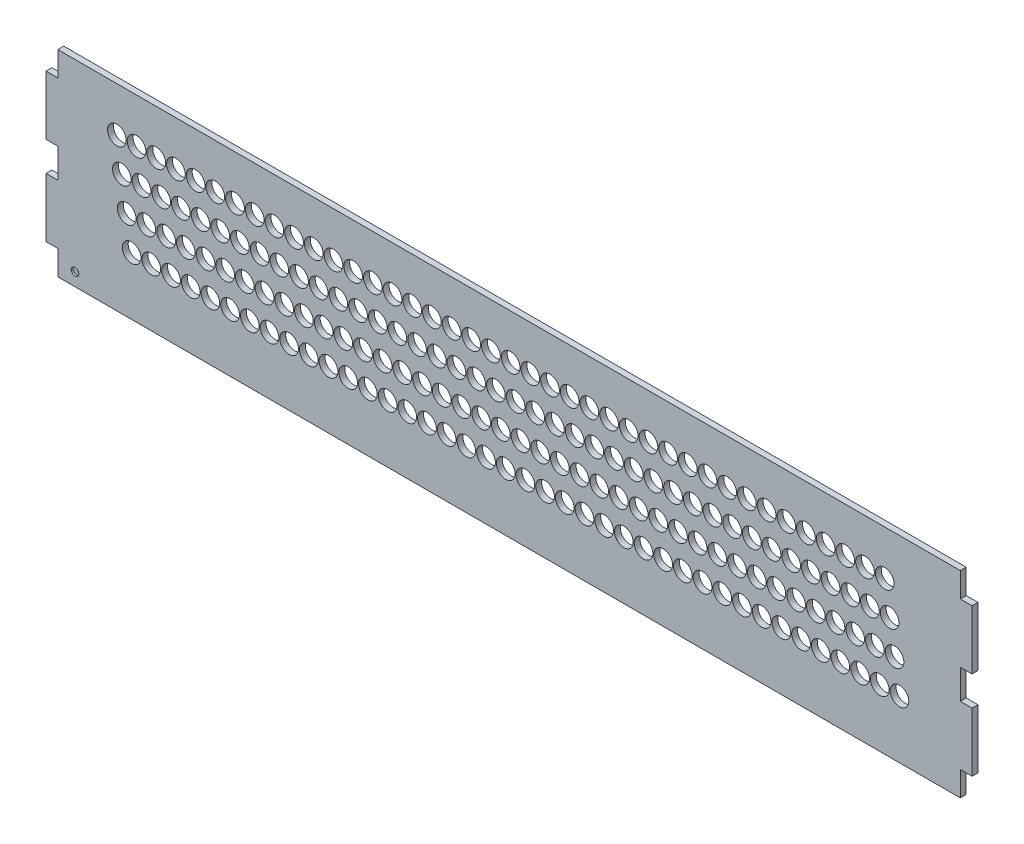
from build123d import *

# Parameters (mm, degrees)
CROQUIS1_W              = 458.4
CROQUIS1_H              = 100
SALIENTE_EXTRUIR1_DEPTH = 3
CROQUIS2_W              = 3
CROQUIS2_H              = 30
SALIENTE_EXTRUIR2_DEPTH = 6
CROQUIS3_W              = 3
CROQUIS3_H              = 30
SALIENTE_EXTRUIR3_DEPTH = 6
CORTAR_EXTRUIR1_REACH   = 242.475
CROQUIS4_R              = 4.75
MATRIZL1_COUNT          = 40
MATRIZL1_PITCH          = 10
CROQUIS5_R              = 1.93471248
CORTAR_EXTRUIR2_DEPTH   = 1


with BuildPart() as part:
    # Croquis1 → Saliente-Extruir1 (new body)
    with BuildSketch(Plane.XY):
        Rectangle(CROQUIS1_W, CROQUIS1_H)
    extrude(amount=SALIENTE_EXTRUIR1_DEPTH)

    # Croquis2 → Saliente-Extruir2 (add)
    with BuildSketch(Plane.ZY.offset(229.2)):
        with Locations((1.5, 22.5)):
            Rectangle(CROQUIS2_W, CROQUIS2_H)
        with Locations((1.5, -22.5)):
            Rectangle(CROQUIS2_W, CROQUIS2_H)
    extrude(amount=SALIENTE_EXTRUIR2_DEPTH)

    # Croquis3 → Saliente-Extruir3 (add)
    with BuildSketch(Plane(origin=(229.2, 0, 0), x_dir=(0, 0, -1), z_dir=(1, 0, 0))):
        with Locations((-1.5, -22.5)):
            Rectangle(CROQUIS3_W, CROQUIS3_H)
        with Locations((-1.5, 22.5)):
            Rectangle(CROQUIS3_W, CROQUIS3_H)
    extrude(amount=SALIENTE_EXTRUIR3_DEPTH)

    # Croquis4 → Cortar-Extruir1 (cut, up to next)
    with BuildSketch(Plane.XY.offset(3), mode=Mode.PRIVATE) as cortar_extruir1_sk1:
        with Locations((-199.2, 27.4)):
            Circle(CROQUIS4_R)
    cortar_extruir1_tool1 = extrude(cortar_extruir1_sk1.sketch, amount=-CORTAR_EXTRUIR1_REACH, mode=Mode.PRIVATE) & part.part
    # Croquis4 → Cortar-Extruir1 (cut, up to next)
    with BuildSketch(Plane.XY.offset(3), mode=Mode.PRIVATE) as cortar_extruir1_sk2:
        with Locations((-196.7, 11.4)):
            Circle(CROQUIS4_R)
    cortar_extruir1_tool2 = extrude(cortar_extruir1_sk2.sketch, amount=-CORTAR_EXTRUIR1_REACH, mode=Mode.PRIVATE) & part.part
    # Croquis4 → Cortar-Extruir1 (cut, up to next)
    with BuildSketch(Plane.XY.offset(3), mode=Mode.PRIVATE) as cortar_extruir1_sk3:
        with Locations((-194.2, -4.6)):
            Circle(CROQUIS4_R)
    cortar_extruir1_tool3 = extrude(cortar_extruir1_sk3.sketch, amount=-CORTAR_EXTRUIR1_REACH, mode=Mode.PRIVATE) & part.part
    # Croquis4 → Cortar-Extruir1 (cut, up to next)
    with BuildSketch(Plane.XY.offset(3), mode=Mode.PRIVATE) as cortar_extruir1_sk4:
        with Locations((-191.7, -20.6)):
            Circle(CROQUIS4_R)
    cortar_extruir1_tool4 = extrude(cortar_extruir1_sk4.sketch, amount=-CORTAR_EXTRUIR1_REACH, mode=Mode.PRIVATE) & part.part
    cortar_extruir1_1 = cortar_extruir1_tool1.solids().sort_by_distance((-199.2, 27.4, 3))[0]
    add(cortar_extruir1_1, mode=Mode.SUBTRACT)
    cortar_extruir1_2 = cortar_extruir1_tool2.solids().sort_by_distance((-196.7, 11.4, 3))[0]
    add(cortar_extruir1_2, mode=Mode.SUBTRACT)
    cortar_extruir1_3 = cortar_extruir1_tool3.solids().sort_by_distance((-194.2, -4.6, 3))[0]
    add(cortar_extruir1_3, mode=Mode.SUBTRACT)
    cortar_extruir1_4 = cortar_extruir1_tool4.solids().sort_by_distance((-191.7, -20.6, 3))[0]
    add(cortar_extruir1_4, mode=Mode.SUBTRACT)
    cortar_extruir1 = cortar_extruir1_1 + cortar_extruir1_2 + cortar_extruir1_3 + cortar_extruir1_4  # Cortar-Extruir1 as one shape, for the pattern or mirror that repeats it

    # MatrizL1: Cortar-Extruir1 ×40
    with Locations(*[(i * MATRIZL1_PITCH, 0, 0) for i in range(1, MATRIZL1_COUNT)]):
        add(cortar_extruir1, mode=Mode.SUBTRACT)

    # Croquis5 → Cortar-Extruir2 (cut)
    with BuildSketch(Plane.XY.offset(3)):
        with Locations((-220.478380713, -43.374846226)):
            Circle(CROQUIS5_R)
    extrude(amount=-CORTAR_EXTRUIR2_DEPTH, mode=Mode.SUBTRACT)


solid = part.part
